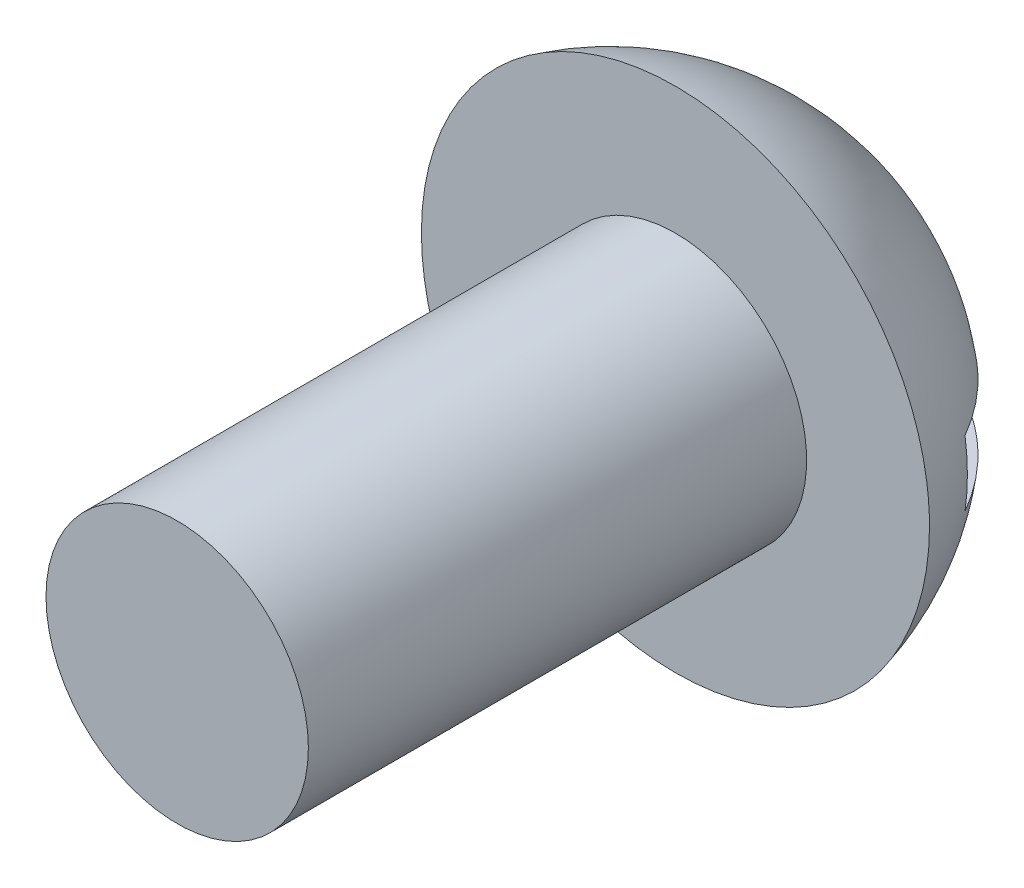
from build123d import *

# Parameters (mm, degrees)
SKETCH2_R           = 1.2573
BOSS_EXTRUDE1_DEPTH = 4.7752
CUT_EXTRUDE1_DEPTH  = 33.916882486


with BuildPart() as part:
    # Sketch1 → Base-Revolve (revolve)
    with BuildSketch(Plane(origin=(0, 0, 0), x_dir=(0, 0, -1), z_dir=(1, 0, 0))):
        with BuildLine():
            Line((-22.86, 15.282157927), (-20.97405, 15.282157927))
            ThreePointArc((-20.97405, 15.282157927), (-21.500684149, 16.822029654), (-22.86, 17.716908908))
            Line((-22.86, 17.716908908), (-22.86, 15.282157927))
        make_face()
    revolve(axis=Axis((0, 15.282157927, 28.59405), (0, 0, -1)))

    # Sketch2 → Boss-Extrude1 (add)
    with BuildSketch(Plane.XY.offset(22.86)):
        with Locations(Location((0, 15.24, 0), (0, 0, 180))):
            Circle(SKETCH2_R)
    extrude(amount=BOSS_EXTRUDE1_DEPTH)

    # Sketch4 → Cut-Extrude1 (cut, through all)
    with BuildSketch(Plane(origin=(0, 0, 0), x_dir=(0, 0, -1), z_dir=(1, 0, 0))):
        with BuildLine():
            Line((-22.251072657, 14.967832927), (-20.993772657, 14.967832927))
            ThreePointArc((-20.993772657, 14.967832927), (-20.97405, 15.282157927), (-20.993772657, 15.596482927))
            Line((-20.993772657, 15.596482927), (-22.251072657, 15.596482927))
            Line((-22.251072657, 15.596482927), (-22.251072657, 14.967832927))
        make_face()
    cut_extrude1 = extrude(amount=-CUT_EXTRUDE1_DEPTH, mode=Mode.SUBTRACT)

    # Mirror1: Cut-Extrude1 across plane
    add(cut_extrude1.mirror(Plane(origin=(0, 15.282157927, 23.48865), x_dir=(0, 0, 1), z_dir=(1, 0, 0))), mode=Mode.SUBTRACT)


solid = part.part
